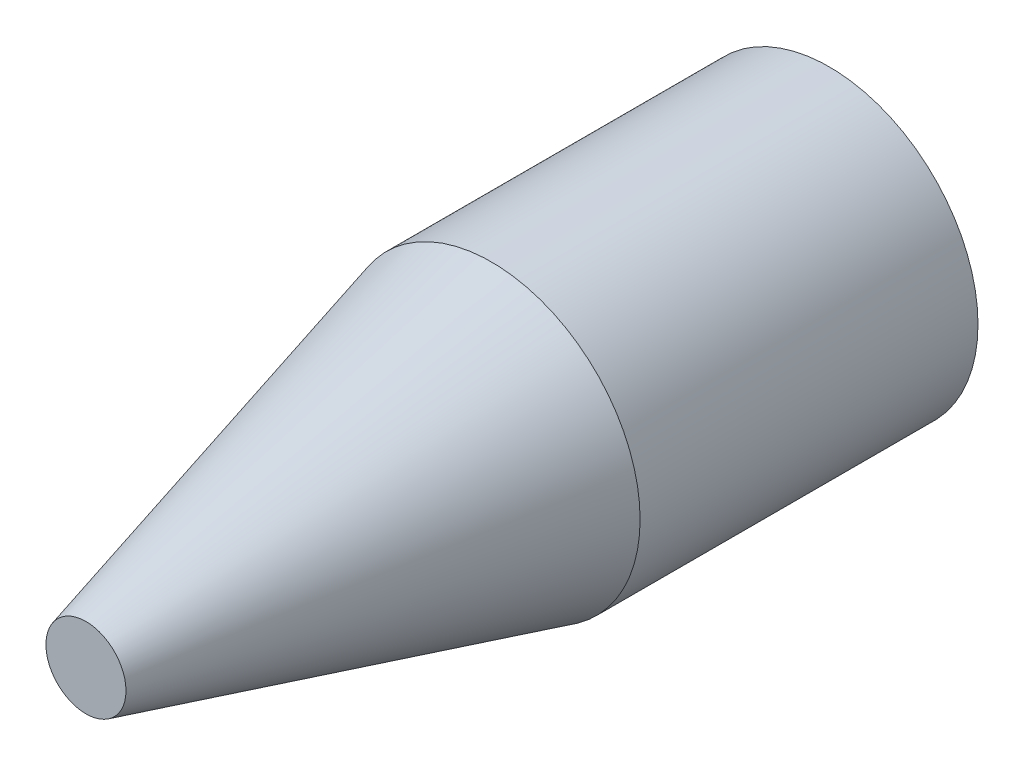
from build123d import *

# Parameters (mm, degrees)
ESQUISSE1_R      = 110
EXTRUSION1_DEPTH = 300
EXTRUSION1_TAPER = 15
ESQUISSE2_R      = 110
EXTRUSION2_DEPTH = 250
COQUE1_T         = -5


with BuildPart() as part:
    # Esquisse1 → Extrusion1 (new body)
    with BuildSketch(Plane.XY):
        Circle(ESQUISSE1_R)
    extrude(amount=EXTRUSION1_DEPTH, taper=EXTRUSION1_TAPER)

    # Esquisse2 → Extrusion2 (add)
    with BuildSketch(Plane(origin=(0, 0, 0), x_dir=(-1, 0, 0), z_dir=(0, 0, -1))):
        with Locations(Location((0, 0, 0), (0, 0, 180))):
            Circle(ESQUISSE2_R)
    extrude(amount=EXTRUSION2_DEPTH)

    # Coque1
    coque1_openings = [part.faces().sort_by_distance(p)[0] for p in [
        (0, 0, -250),
    ]]
    offset(amount=COQUE1_T, openings=coque1_openings, kind=Kind.INTERSECTION)


solid = part.part
